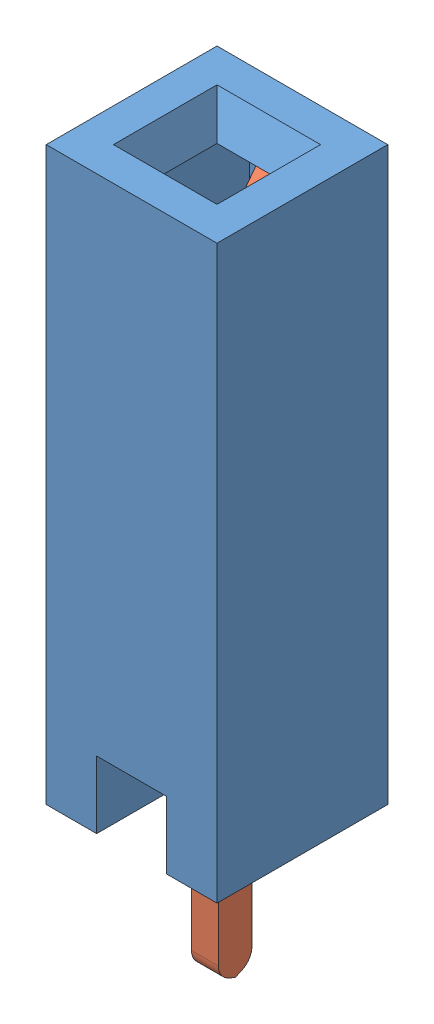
SolidWorks assembly header.SLDASM, configuration Default (file format 5000). Lengths in mm.
Overall size (2.54 10.59 2.54).
2 component instances, 2 part files, 2 mates.
Components (placement in the parent):
- header-1: header.SLDPRT [Default] at origin size (2.54 8.5 2.54)
- pin-1: pin.sldprt [Default] at (-1.4 0 0) size (0.4 10 1.99)
Mates (geometry in assembly coordinates):
- Distance1: distance = 0.25 mm anti-aligned: plane of pin-1 through (-1 -1.82 1.2699) normal (1 0 0); plane of header-1 through (-0.75 0 2.54) normal (-1 0 0)
- Distance2: distance = 1.9064 mm aligned: plane of pin-1 through (-1 1.9064 2.0215) normal (0 -1 0); plane of header-1 through (0 0 2.54) normal (0 -1 0)
